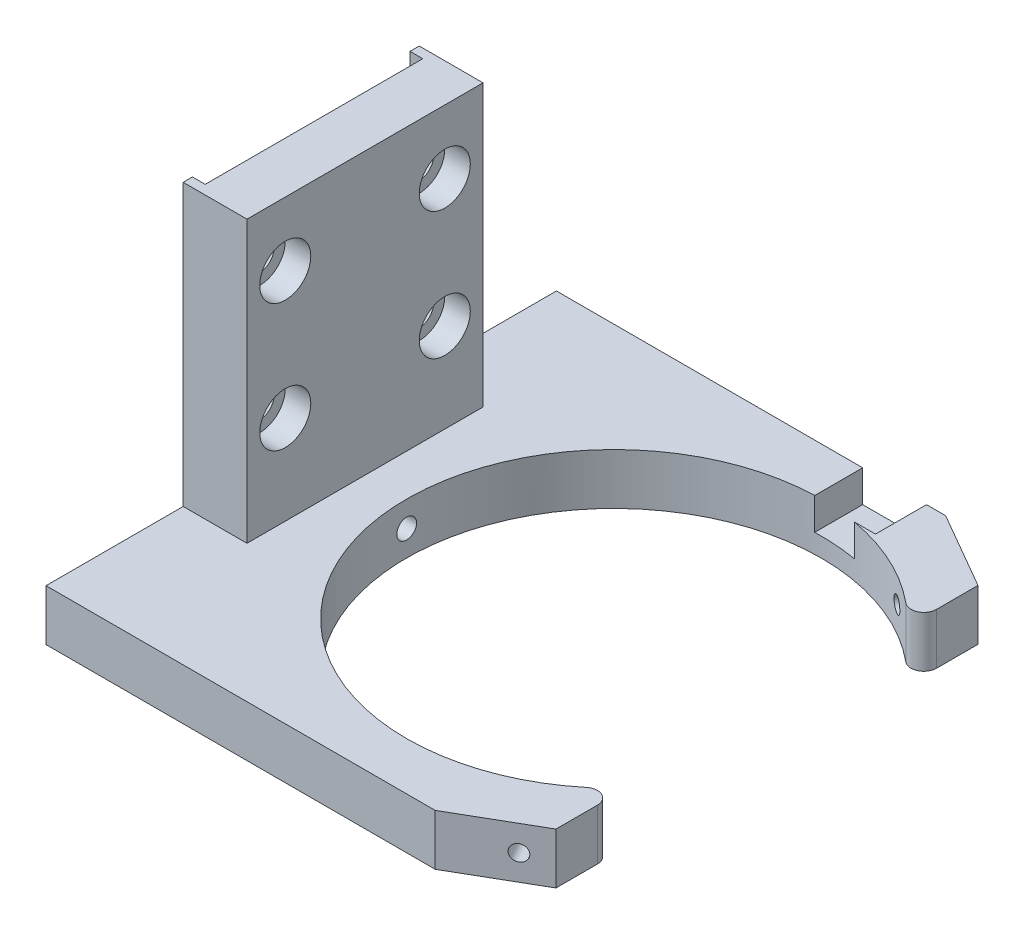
from build123d import *

# Parameters (mm, degrees)
BOSS_EXTRUDE1_DEPTH            = 8
SKETCH3_W                      = 10
SKETCH3_H                      = 37
BOSS_EXTRUDE2_DEPTH            = 44
CBORE_FOR_M4_SHCS1_D           = 4.5
CBORE_FOR_M4_SHCS1_CBORE_D     = 8
CBORE_FOR_M4_SHCS1_CBORE_DEPTH = 4
SKETCH13_W                     = 34.1
SKETCH13_H                     = 52
CUT_EXTRUDE3_DEPTH             = 2
CUT_EXTRUDE4_DEPTH             = 10
FILLET4_R                      = 2
FILLET4_OF_MIRROR2_R           = 2
SKETCH34_W                     = 10
SKETCH34_H                     = 8
CUT_EXTRUDE5_DEPTH             = 5
F_3_1_3_1_DIAMETER_HOLE1_D     = 3.1
F_3_1_3_1_DIAMETER_HOLE1_DEPTH = 67.724637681
F_3_1_3_1_DIAMETER_HOLE1_TIP   = 0.931333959
M4X0_7_TAPPED_HOLE3_D          = 3.3
M4X0_7_TAPPED_HOLE3_DEPTH      = 11.5
M4X0_7_TAPPED_HOLE3_TIP        = 0.991420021
CIRPATTERN1_COUNT              = 2
CIRPATTERN1_ANGLE              = 240


with BuildPart() as part:
    # Sketch2 → Boss-Extrude1 (new body)
    with BuildSketch(Plane(origin=(0, 0, 0), x_dir=(1, 0, 0), z_dir=(0, 1, 0))):
        with BuildLine():
            Line((-49, -40), (26, -40))
            Line((26, -40), (26, -19.5))
            ThreePointArc((26, -19.5), (-32.5, 0), (26, 19.5))
            Line((26, 19.5), (26, 40))
            Line((26, 40), (-49, 40))
            Line((-49, 40), (-49, -40))
        make_face()
    extrude(amount=BOSS_EXTRUDE1_DEPTH)

    # Sketch3 → Boss-Extrude2 (add)
    with BuildSketch(Plane(origin=(0, 8, 0), x_dir=(1, 0, 0), z_dir=(0, 1, 0))):
        with Locations((-44, 0)):
            Rectangle(SKETCH3_W, SKETCH3_H)
    extrude(amount=BOSS_EXTRUDE2_DEPTH)

    # CBORE for M4 SHCS1 (through all)
    with Locations(Plane(origin=(-39, 0, 0), x_dir=(0, 0, -1), z_dir=(1, 0, 0))):
        with Locations((-12.5, 42), (12.5, 42), (12.5, 22), (-12.5, 22)):
            CounterBoreHole(CBORE_FOR_M4_SHCS1_D / 2, CBORE_FOR_M4_SHCS1_CBORE_D / 2, CBORE_FOR_M4_SHCS1_CBORE_DEPTH)

    # Sketch13 → Cut-Extrude3 (cut)
    with BuildSketch(Plane.ZY.offset(49)):
        with Locations((0, 26)):
            Rectangle(SKETCH13_W, SKETCH13_H)
    extrude(amount=-CUT_EXTRUDE3_DEPTH, mode=Mode.SUBTRACT)

    # Sketch20 → Cut-Extrude4 (cut)
    with BuildSketch(Plane.XZ):
        Polygon((12, 40), (24, 33.07179677), (24, 15), (26, 15), (26, 40), align=None)
    cut_extrude4 = extrude(amount=-CUT_EXTRUDE4_DEPTH, mode=Mode.SUBTRACT)

    # Fillet4
    fillet4_edges = [part.edges().sort_by_distance(p)[0] for p in [
        (24, 4, 21.914607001),
    ]]
    fillet(fillet4_edges, radius=FILLET4_R)

    # Mirror2: Cut-Extrude4 across plane
    add(cut_extrude4.mirror(Plane.XY), mode=Mode.SUBTRACT)

    # Fillet4 of Mirror2
    fillet4_of_mirror2_edges = [part.edges().sort_by_distance(p)[0] for p in [
        (24, 4, -21.914607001),
    ]]
    fillet(fillet4_of_mirror2_edges, radius=FILLET4_OF_MIRROR2_R)

    # Sketch30 → M3x0.5 Tapped Hole1 (revolve, cut)
    with BuildSketch(Plane(origin=(20.320508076, 4, 35.196152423), x_dir=(0.8660254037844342, 0, -0.5000000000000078), z_dir=(0, 1, 0))):
        Polygon((0, 0), (0, 41.391091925), (1.25, 40.640016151), (1.25, 0), align=None)
    m3x0_5_tapped_hole1 = revolve(axis=Axis((23.495508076, 4, 40.695413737), (-0.5000000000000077, 0, -0.8660254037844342)), mode=Mode.SUBTRACT)

    # Sketch34 → Cut-Extrude5 (cut)
    with BuildSketch(Plane(origin=(0, 8, 0), x_dir=(1, 0, 0), z_dir=(0, 1, 0))):
        with Locations((4, 36)):
            Rectangle(SKETCH34_W, SKETCH34_H)
    extrude(amount=-CUT_EXTRUDE5_DEPTH, mode=Mode.SUBTRACT)

    # 3.1 _3.1_ Diameter Hole1
    with Locations(Plane.ZY.offset(47)):
        with Locations((0, 4)):
            Hole(F_3_1_3_1_DIAMETER_HOLE1_D / 2, depth=F_3_1_3_1_DIAMETER_HOLE1_DEPTH)
            with Locations((0, 0, -(F_3_1_3_1_DIAMETER_HOLE1_DEPTH + F_3_1_3_1_DIAMETER_HOLE1_TIP / 2))):  # 118° drill point
                Cone(0, F_3_1_3_1_DIAMETER_HOLE1_D / 2, F_3_1_3_1_DIAMETER_HOLE1_TIP, mode=Mode.SUBTRACT)

    # M4x0.7 Tapped Hole3
    with Locations(Plane.ZY.offset(47)):
        with Locations((0, 4)):
            Hole(M4X0_7_TAPPED_HOLE3_D / 2, depth=M4X0_7_TAPPED_HOLE3_DEPTH)
            with Locations((0, 0, -(M4X0_7_TAPPED_HOLE3_DEPTH + M4X0_7_TAPPED_HOLE3_TIP / 2))):  # 118° drill point
                Cone(0, M4X0_7_TAPPED_HOLE3_D / 2, M4X0_7_TAPPED_HOLE3_TIP, mode=Mode.SUBTRACT)

    # CirPattern1: M3x0.5 Tapped Hole1 ×2 about axis
    cirpattern1_axis = Axis((0, 8, 0), (0, -1, 0))
    for i in range(1, CIRPATTERN1_COUNT):
        add(m3x0_5_tapped_hole1.rotate(cirpattern1_axis, i * CIRPATTERN1_ANGLE / (CIRPATTERN1_COUNT - 1)), mode=Mode.SUBTRACT)


solid = part.part
